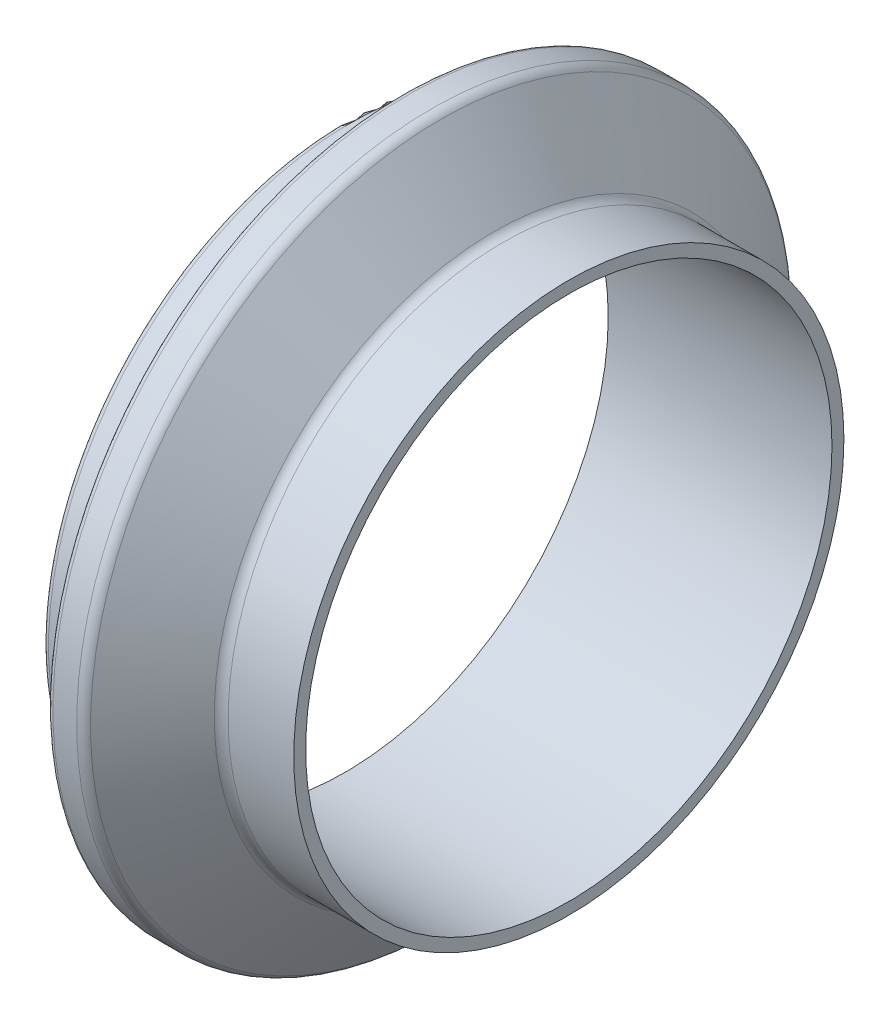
ISO-10303-21;
HEADER;
FILE_DESCRIPTION(('STEP AP214'),'2;1');
FILE_NAME('part.step','',(''),(''),'','','');
FILE_SCHEMA(('AUTOMOTIVE_DESIGN { 1 0 10303 214 1 1 1 1 }'));
ENDSEC;
DATA;
#1=APPLICATION_CONTEXT('core data for automotive mechanical design processes');
#2=APPLICATION_PROTOCOL_DEFINITION('international standard','automotive_design',2000,#1);
#3=PRODUCT_CONTEXT('',#1,'mechanical');
#4=PRODUCT('Part','Part','',(#3));
#5=PRODUCT_RELATED_PRODUCT_CATEGORY('part','',(#4));
#6=PRODUCT_DEFINITION_FORMATION('','',#4);
#7=PRODUCT_DEFINITION_CONTEXT('part definition',#1,'design');
#8=PRODUCT_DEFINITION('design','',#6,#7);
#9=PRODUCT_DEFINITION_SHAPE('','',#8);
#10=(LENGTH_UNIT() NAMED_UNIT(*) SI_UNIT(.MILLI.,.METRE.));
#11=(NAMED_UNIT(*) PLANE_ANGLE_UNIT() SI_UNIT($,.RADIAN.));
#12=(NAMED_UNIT(*) SI_UNIT($,.STERADIAN.) SOLID_ANGLE_UNIT());
#13=UNCERTAINTY_MEASURE_WITH_UNIT(LENGTH_MEASURE(1.E-05),#10,'distance_accuracy_value','');
#14=(GEOMETRIC_REPRESENTATION_CONTEXT(3) GLOBAL_UNCERTAINTY_ASSIGNED_CONTEXT((#13)) GLOBAL_UNIT_ASSIGNED_CONTEXT((#10,
#11,#12)) REPRESENTATION_CONTEXT('',''));
#15=CARTESIAN_POINT('',(0.,0.,0.));
#16=DIRECTION('',(0.,0.,1.));
#17=DIRECTION('',(1.,0.,0.));
#18=AXIS2_PLACEMENT_3D('',#15,#16,#17);
#19=CARTESIAN_POINT('',(0.,38.1,0.));
#20=DIRECTION('',(1.,0.,0.));
#21=DIRECTION('',(0.,0.,-1.));
#22=AXIS2_PLACEMENT_3D('',#19,#20,#21);
#23=PLANE('',#22);
#24=CARTESIAN_POINT('',(0.,0.,0.));
#25=DIRECTION('',(1.,0.,0.));
#26=DIRECTION('',(0.,0.,-1.));
#27=AXIS2_PLACEMENT_3D('',#24,#25,#26);
#28=CIRCLE('',#27,38.1);
#29=CARTESIAN_POINT('',(0.,0.,-38.1));
#30=VERTEX_POINT('',#29);
#31=EDGE_CURVE('E10',#30,#30,#28,.T.);
#32=ORIENTED_EDGE('',*,*,#31,.T.);
#33=EDGE_LOOP('',(#32));
#34=FACE_BOUND('',#33,.T.);
#35=CARTESIAN_POINT('',(0.,0.,0.));
#36=DIRECTION('',(1.,0.,0.));
#37=DIRECTION('',(0.,0.,-1.));
#38=AXIS2_PLACEMENT_3D('',#35,#36,#37);
#39=CIRCLE('',#38,36.449);
#40=CARTESIAN_POINT('',(0.,0.,-36.449));
#41=VERTEX_POINT('',#40);
#42=EDGE_CURVE('E74',#41,#41,#39,.T.);
#43=ORIENTED_EDGE('',*,*,#42,.F.);
#44=EDGE_LOOP('',(#43));
#45=FACE_BOUND('',#44,.T.);
#46=ADVANCED_FACE('F31',(#34,#45),#23,.T.);
#47=CARTESIAN_POINT('',(0.,0.,0.));
#48=DIRECTION('',(1.,0.,0.));
#49=DIRECTION('',(0.,0.,-1.));
#50=AXIS2_PLACEMENT_3D('',#47,#48,#49);
#51=CYLINDRICAL_SURFACE('',#50,38.1);
#52=CARTESIAN_POINT('',(-9.08795101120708,0.,0.));
#53=DIRECTION('',(1.,0.,0.));
#54=DIRECTION('',(0.,0.,-1.));
#55=AXIS2_PLACEMENT_3D('',#52,#53,#54);
#56=CIRCLE('',#55,38.1);
#57=CARTESIAN_POINT('',(-9.08795101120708,0.,-38.1));
#58=VERTEX_POINT('',#57);
#59=EDGE_CURVE('E37',#58,#58,#56,.T.);
#60=ORIENTED_EDGE('',*,*,#59,.T.);
#61=EDGE_LOOP('',(#60));
#62=FACE_BOUND('',#61,.T.);
#63=ORIENTED_EDGE('',*,*,#31,.F.);
#64=EDGE_LOOP('',(#63));
#65=FACE_BOUND('',#64,.T.);
#66=ADVANCED_FACE('F82',(#62,#65),#51,.T.);
#67=CARTESIAN_POINT('',(-9.08795101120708,0.,0.));
#68=DIRECTION('',(1.,0.,0.));
#69=DIRECTION('',(0.,0.,-1.));
#70=AXIS2_PLACEMENT_3D('',#67,#68,#69);
#71=TOROIDAL_SURFACE('',#70,39.7002,1.60020000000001);
#72=CARTESIAN_POINT('',(-10.3659275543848,0.,0.));
#73=DIRECTION('',(1.,0.,0.));
#74=DIRECTION('',(0.,0.,-1.));
#75=AXIS2_PLACEMENT_3D('',#72,#73,#74);
#76=CIRCLE('',#75,38.7371755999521);
#77=CARTESIAN_POINT('',(-10.3659275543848,0.,-38.7371755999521));
#78=VERTEX_POINT('',#77);
#79=EDGE_CURVE('E41',#78,#78,#76,.T.);
#80=ORIENTED_EDGE('',*,*,#79,.T.);
#81=EDGE_LOOP('',(#80));
#82=FACE_BOUND('',#81,.T.);
#83=ORIENTED_EDGE('',*,*,#59,.F.);
#84=EDGE_LOOP('',(#83));
#85=FACE_BOUND('',#84,.T.);
#86=ADVANCED_FACE('F86',(#82,#85),#71,.F.);
#87=CARTESIAN_POINT('',(-10.3659275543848,0.,0.));
#88=DIRECTION('',(-1.,0.,0.));
#89=DIRECTION('',(0.,0.,1.));
#90=AXIS2_PLACEMENT_3D('',#87,#88,#89);
#91=CONICAL_SURFACE('',#90,38.7371755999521,0.925024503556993);
#92=CARTESIAN_POINT('',(-17.7316537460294,0.,0.));
#93=DIRECTION('',(1.,0.,0.));
#94=DIRECTION('',(0.,0.,-1.));
#95=AXIS2_PLACEMENT_3D('',#92,#93,#94);
#96=CIRCLE('',#95,48.5118244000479);
#97=CARTESIAN_POINT('',(-17.7316537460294,0.,-48.5118244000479));
#98=VERTEX_POINT('',#97);
#99=EDGE_CURVE('E45',#98,#98,#96,.T.);
#100=ORIENTED_EDGE('',*,*,#99,.T.);
#101=EDGE_LOOP('',(#100));
#102=FACE_BOUND('',#101,.T.);
#103=ORIENTED_EDGE('',*,*,#79,.F.);
#104=EDGE_LOOP('',(#103));
#105=FACE_BOUND('',#104,.T.);
#106=ADVANCED_FACE('F90',(#102,#105),#91,.T.);
#107=CARTESIAN_POINT('',(-19.0096302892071,0.,0.));
#108=DIRECTION('',(1.,0.,0.));
#109=DIRECTION('',(0.,0.,-1.));
#110=AXIS2_PLACEMENT_3D('',#107,#108,#109);
#111=TOROIDAL_SURFACE('',#110,47.5488,1.60020000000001);
#112=CARTESIAN_POINT('',(-19.0096302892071,0.,0.));
#113=DIRECTION('',(1.,0.,0.));
#114=DIRECTION('',(0.,0.,-1.));
#115=AXIS2_PLACEMENT_3D('',#112,#113,#114);
#116=CIRCLE('',#115,49.149);
#117=CARTESIAN_POINT('',(-19.0096302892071,0.,-49.149));
#118=VERTEX_POINT('',#117);
#119=EDGE_CURVE('E50',#118,#118,#116,.T.);
#120=ORIENTED_EDGE('',*,*,#119,.T.);
#121=EDGE_LOOP('',(#120));
#122=FACE_BOUND('',#121,.T.);
#123=ORIENTED_EDGE('',*,*,#99,.F.);
#124=EDGE_LOOP('',(#123));
#125=FACE_BOUND('',#124,.T.);
#126=ADVANCED_FACE('F97',(#122,#125),#111,.T.);
#127=CARTESIAN_POINT('',(0.,0.,0.));
#128=DIRECTION('',(1.,0.,0.));
#129=DIRECTION('',(0.,0.,-1.));
#130=AXIS2_PLACEMENT_3D('',#127,#128,#129);
#131=CYLINDRICAL_SURFACE('',#130,49.149);
#132=CARTESIAN_POINT('',(-22.3012,0.,0.));
#133=DIRECTION('',(1.,0.,0.));
#134=DIRECTION('',(0.,0.,-1.));
#135=AXIS2_PLACEMENT_3D('',#132,#133,#134);
#136=CIRCLE('',#135,49.149);
#137=CARTESIAN_POINT('',(-22.3012,0.,-49.149));
#138=VERTEX_POINT('',#137);
#139=EDGE_CURVE('E53',#138,#138,#136,.T.);
#140=ORIENTED_EDGE('',*,*,#139,.T.);
#141=EDGE_LOOP('',(#140));
#142=FACE_BOUND('',#141,.T.);
#143=ORIENTED_EDGE('',*,*,#119,.F.);
#144=EDGE_LOOP('',(#143));
#145=FACE_BOUND('',#144,.T.);
#146=ADVANCED_FACE('F101',(#142,#145),#131,.T.);
#147=CARTESIAN_POINT('',(-22.3012,0.,0.));
#148=DIRECTION('',(1.,0.,0.));
#149=DIRECTION('',(0.,0.,-1.));
#150=AXIS2_PLACEMENT_3D('',#147,#148,#149);
#151=TOROIDAL_SURFACE('',#150,48.3362,0.812800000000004);
#152=CARTESIAN_POINT('',(-23.114,0.,0.));
#153=DIRECTION('',(1.,0.,0.));
#154=DIRECTION('',(0.,0.,-1.));
#155=AXIS2_PLACEMENT_3D('',#152,#153,#154);
#156=CIRCLE('',#155,48.3362);
#157=CARTESIAN_POINT('',(-23.114,0.,-48.3362));
#158=VERTEX_POINT('',#157);
#159=EDGE_CURVE('E56',#158,#158,#156,.T.);
#160=ORIENTED_EDGE('',*,*,#159,.T.);
#161=EDGE_LOOP('',(#160));
#162=FACE_BOUND('',#161,.T.);
#163=ORIENTED_EDGE('',*,*,#139,.F.);
#164=EDGE_LOOP('',(#163));
#165=FACE_BOUND('',#164,.T.);
#166=ADVANCED_FACE('F105',(#162,#165),#151,.T.);
#167=CARTESIAN_POINT('',(-23.114,42.6974,0.));
#168=DIRECTION('',(-1.,0.,0.));
#169=DIRECTION('',(0.,0.,1.));
#170=AXIS2_PLACEMENT_3D('',#167,#168,#169);
#171=PLANE('',#170);
#172=CARTESIAN_POINT('',(-23.114,0.,0.));
#173=DIRECTION('',(1.,0.,0.));
#174=DIRECTION('',(0.,0.,-1.));
#175=AXIS2_PLACEMENT_3D('',#172,#173,#174);
#176=CIRCLE('',#175,42.6974);
#177=CARTESIAN_POINT('',(-23.114,0.,-42.6974));
#178=VERTEX_POINT('',#177);
#179=EDGE_CURVE('E59',#178,#178,#176,.T.);
#180=ORIENTED_EDGE('',*,*,#179,.T.);
#181=EDGE_LOOP('',(#180));
#182=FACE_BOUND('',#181,.T.);
#183=ORIENTED_EDGE('',*,*,#159,.F.);
#184=EDGE_LOOP('',(#183));
#185=FACE_BOUND('',#184,.T.);
#186=ADVANCED_FACE('F109',(#182,#185),#171,.T.);
#187=CARTESIAN_POINT('',(-23.9268,0.,0.));
#188=DIRECTION('',(1.,0.,0.));
#189=DIRECTION('',(0.,0.,-1.));
#190=AXIS2_PLACEMENT_3D('',#187,#188,#189);
#191=TOROIDAL_SURFACE('',#190,42.6974,0.812799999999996);
#192=CARTESIAN_POINT('',(-23.9268,0.,0.));
#193=DIRECTION('',(1.,0.,0.));
#194=DIRECTION('',(0.,0.,-1.));
#195=AXIS2_PLACEMENT_3D('',#192,#193,#194);
#196=CIRCLE('',#195,41.8846);
#197=CARTESIAN_POINT('',(-23.9268,0.,-41.8846));
#198=VERTEX_POINT('',#197);
#199=EDGE_CURVE('E62',#198,#198,#196,.T.);
#200=ORIENTED_EDGE('',*,*,#199,.T.);
#201=EDGE_LOOP('',(#200));
#202=FACE_BOUND('',#201,.T.);
#203=ORIENTED_EDGE('',*,*,#179,.F.);
#204=EDGE_LOOP('',(#203));
#205=FACE_BOUND('',#204,.T.);
#206=ADVANCED_FACE('F113',(#202,#205),#191,.F.);
#207=CARTESIAN_POINT('',(0.,0.,0.));
#208=DIRECTION('',(1.,0.,0.));
#209=DIRECTION('',(0.,0.,-1.));
#210=AXIS2_PLACEMENT_3D('',#207,#208,#209);
#211=CYLINDRICAL_SURFACE('',#210,41.8846);
#212=CARTESIAN_POINT('',(-30.1752,0.,0.));
#213=DIRECTION('',(1.,0.,0.));
#214=DIRECTION('',(0.,0.,-1.));
#215=AXIS2_PLACEMENT_3D('',#212,#213,#214);
#216=CIRCLE('',#215,41.8846);
#217=CARTESIAN_POINT('',(-30.1752,0.,-41.8846));
#218=VERTEX_POINT('',#217);
#219=EDGE_CURVE('E65',#218,#218,#216,.T.);
#220=ORIENTED_EDGE('',*,*,#219,.T.);
#221=EDGE_LOOP('',(#220));
#222=FACE_BOUND('',#221,.T.);
#223=ORIENTED_EDGE('',*,*,#199,.F.);
#224=EDGE_LOOP('',(#223));
#225=FACE_BOUND('',#224,.T.);
#226=ADVANCED_FACE('F117',(#222,#225),#211,.T.);
#227=CARTESIAN_POINT('',(-30.1752,0.,0.));
#228=DIRECTION('',(1.,0.,0.));
#229=DIRECTION('',(0.,0.,-1.));
#230=AXIS2_PLACEMENT_3D('',#227,#228,#229);
#231=TOROIDAL_SURFACE('',#230,41.0718,0.812799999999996);
#232=CARTESIAN_POINT('',(-30.988,0.,0.));
#233=DIRECTION('',(1.,0.,0.));
#234=DIRECTION('',(0.,0.,-1.));
#235=AXIS2_PLACEMENT_3D('',#232,#233,#234);
#236=CIRCLE('',#235,41.0718);
#237=CARTESIAN_POINT('',(-30.988,0.,-41.0718));
#238=VERTEX_POINT('',#237);
#239=EDGE_CURVE('E68',#238,#238,#236,.T.);
#240=ORIENTED_EDGE('',*,*,#239,.T.);
#241=EDGE_LOOP('',(#240));
#242=FACE_BOUND('',#241,.T.);
#243=ORIENTED_EDGE('',*,*,#219,.F.);
#244=EDGE_LOOP('',(#243));
#245=FACE_BOUND('',#244,.T.);
#246=ADVANCED_FACE('F121',(#242,#245),#231,.T.);
#247=CARTESIAN_POINT('',(-30.988,36.449,0.));
#248=DIRECTION('',(-1.,0.,0.));
#249=DIRECTION('',(0.,0.,1.));
#250=AXIS2_PLACEMENT_3D('',#247,#248,#249);
#251=PLANE('',#250);
#252=CARTESIAN_POINT('',(-30.988,0.,0.));
#253=DIRECTION('',(1.,0.,0.));
#254=DIRECTION('',(0.,0.,-1.));
#255=AXIS2_PLACEMENT_3D('',#252,#253,#254);
#256=CIRCLE('',#255,36.449);
#257=CARTESIAN_POINT('',(-30.988,0.,-36.449));
#258=VERTEX_POINT('',#257);
#259=EDGE_CURVE('E71',#258,#258,#256,.T.);
#260=ORIENTED_EDGE('',*,*,#259,.T.);
#261=EDGE_LOOP('',(#260));
#262=FACE_BOUND('',#261,.T.);
#263=ORIENTED_EDGE('',*,*,#239,.F.);
#264=EDGE_LOOP('',(#263));
#265=FACE_BOUND('',#264,.T.);
#266=ADVANCED_FACE('F125',(#262,#265),#251,.T.);
#267=CARTESIAN_POINT('',(0.,0.,0.));
#268=DIRECTION('',(1.,0.,0.));
#269=DIRECTION('',(0.,0.,-1.));
#270=AXIS2_PLACEMENT_3D('',#267,#268,#269);
#271=CYLINDRICAL_SURFACE('',#270,36.449);
#272=ORIENTED_EDGE('',*,*,#42,.T.);
#273=EDGE_LOOP('',(#272));
#274=FACE_BOUND('',#273,.T.);
#275=ORIENTED_EDGE('',*,*,#259,.F.);
#276=EDGE_LOOP('',(#275));
#277=FACE_BOUND('',#276,.T.);
#278=ADVANCED_FACE('F78',(#274,#277),#271,.F.);
#279=CLOSED_SHELL('',(#46,#66,#86,#106,#126,#146,#166,#186,#206,#226,#246,#266,#278));
#280=MANIFOLD_SOLID_BREP('B2',#279);
#281=ADVANCED_BREP_SHAPE_REPRESENTATION('',(#18,#280),#14);
#282=SHAPE_DEFINITION_REPRESENTATION(#9,#281);
ENDSEC;
END-ISO-10303-21;
